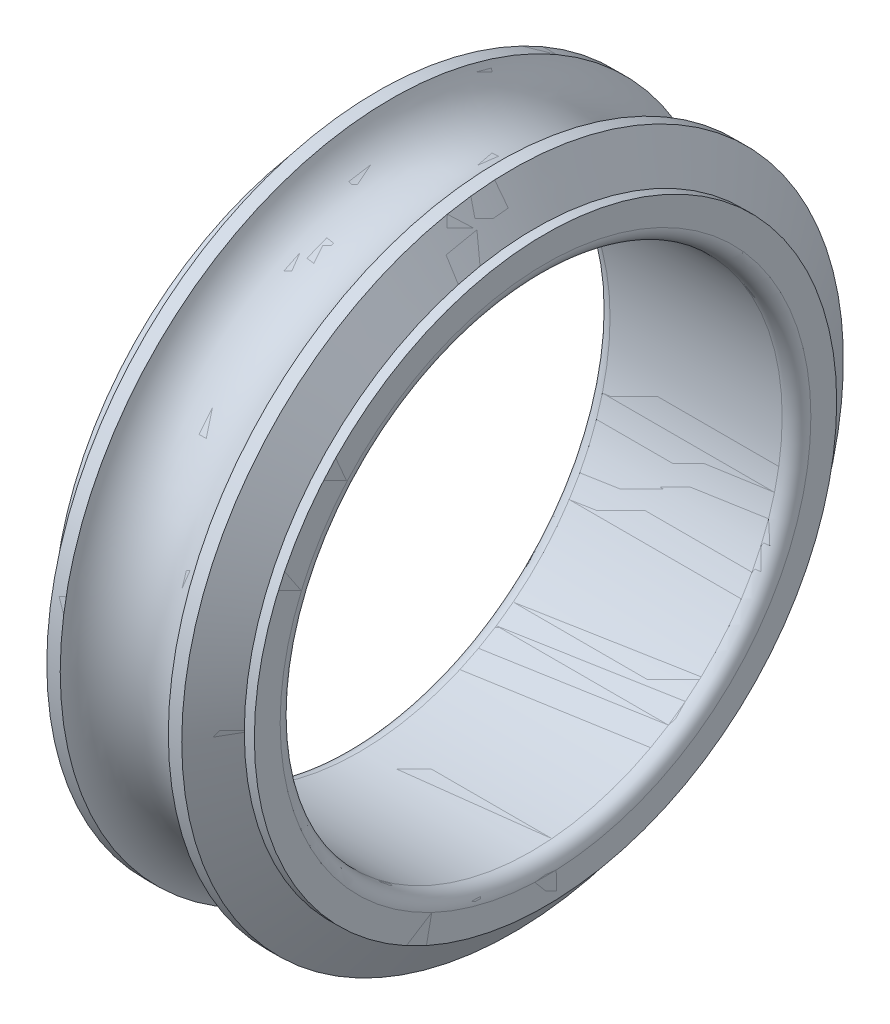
ISO-10303-21;
HEADER;
FILE_DESCRIPTION(('STEP AP214'),'2;1');
FILE_NAME('part.step','',(''),(''),'','','');
FILE_SCHEMA(('AUTOMOTIVE_DESIGN { 1 0 10303 214 1 1 1 1 }'));
ENDSEC;
DATA;
#1=APPLICATION_CONTEXT('core data for automotive mechanical design processes');
#2=APPLICATION_PROTOCOL_DEFINITION('international standard','automotive_design',2000,#1);
#3=PRODUCT_CONTEXT('',#1,'mechanical');
#4=PRODUCT('Part','Part','',(#3));
#5=PRODUCT_RELATED_PRODUCT_CATEGORY('part','',(#4));
#6=PRODUCT_DEFINITION_FORMATION('','',#4);
#7=PRODUCT_DEFINITION_CONTEXT('part definition',#1,'design');
#8=PRODUCT_DEFINITION('design','',#6,#7);
#9=PRODUCT_DEFINITION_SHAPE('','',#8);
#10=(LENGTH_UNIT() NAMED_UNIT(*) SI_UNIT(.MILLI.,.METRE.));
#11=(NAMED_UNIT(*) PLANE_ANGLE_UNIT() SI_UNIT($,.RADIAN.));
#12=(NAMED_UNIT(*) SI_UNIT($,.STERADIAN.) SOLID_ANGLE_UNIT());
#13=UNCERTAINTY_MEASURE_WITH_UNIT(LENGTH_MEASURE(1.E-05),#10,'distance_accuracy_value','');
#14=(GEOMETRIC_REPRESENTATION_CONTEXT(3) GLOBAL_UNCERTAINTY_ASSIGNED_CONTEXT((#13)) GLOBAL_UNIT_ASSIGNED_CONTEXT((#10,
#11,#12)) REPRESENTATION_CONTEXT('',''));
#15=CARTESIAN_POINT('',(0.,0.,0.));
#16=DIRECTION('',(0.,0.,1.));
#17=DIRECTION('',(1.,0.,0.));
#18=AXIS2_PLACEMENT_3D('',#15,#16,#17);
#19=CARTESIAN_POINT('',(13.,0.,0.));
#20=DIRECTION('',(-1.,0.,0.));
#21=DIRECTION('',(0.,0.,1.));
#22=AXIS2_PLACEMENT_3D('',#19,#20,#21);
#23=TOROIDAL_SURFACE('',#22,18.5,1.);
#24=CARTESIAN_POINT('',(14.,0.,0.));
#25=DIRECTION('',(-1.,0.,0.));
#26=DIRECTION('',(0.,0.,1.));
#27=AXIS2_PLACEMENT_3D('',#24,#25,#26);
#28=CIRCLE('',#27,18.5);
#29=CARTESIAN_POINT('',(14.,0.,18.5));
#30=VERTEX_POINT('',#29);
#31=EDGE_CURVE('P0_E10',#30,#30,#28,.T.);
#32=ORIENTED_EDGE('',*,*,#31,.F.);
#33=EDGE_LOOP('',(#32));
#34=FACE_BOUND('',#33,.T.);
#35=CARTESIAN_POINT('',(13.,0.,0.));
#36=DIRECTION('',(-1.,0.,0.));
#37=DIRECTION('',(0.,0.,1.));
#38=AXIS2_PLACEMENT_3D('',#35,#36,#37);
#39=CIRCLE('',#38,17.5);
#40=CARTESIAN_POINT('',(13.,0.,17.5));
#41=VERTEX_POINT('',#40);
#42=EDGE_CURVE('P0_E68',#41,#41,#39,.T.);
#43=ORIENTED_EDGE('',*,*,#42,.T.);
#44=EDGE_LOOP('',(#43));
#45=FACE_BOUND('',#44,.T.);
#46=ADVANCED_FACE('P0_F28',(#34,#45),#23,.T.);
#47=CARTESIAN_POINT('',(14.,18.5,0.));
#48=DIRECTION('',(-1.,0.,0.));
#49=DIRECTION('',(0.,0.,1.));
#50=AXIS2_PLACEMENT_3D('',#47,#48,#49);
#51=PLANE('',#50);
#52=CARTESIAN_POINT('',(14.,0.,0.));
#53=DIRECTION('',(-1.,0.,0.));
#54=DIRECTION('',(0.,0.,1.));
#55=AXIS2_PLACEMENT_3D('',#52,#53,#54);
#56=CIRCLE('',#55,20.3000001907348);
#57=CARTESIAN_POINT('',(14.,0.,20.3000001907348));
#58=VERTEX_POINT('',#57);
#59=EDGE_CURVE('P0_E34',#58,#58,#56,.T.);
#60=ORIENTED_EDGE('',*,*,#59,.F.);
#61=EDGE_LOOP('',(#60));
#62=FACE_BOUND('',#61,.T.);
#63=ORIENTED_EDGE('',*,*,#31,.T.);
#64=EDGE_LOOP('',(#63));
#65=FACE_BOUND('',#64,.T.);
#66=ADVANCED_FACE('P0_F122',(#62,#65),#51,.F.);
#67=CARTESIAN_POINT('',(0.,0.,0.));
#68=DIRECTION('',(-1.,0.,0.));
#69=DIRECTION('',(0.,0.,1.));
#70=AXIS2_PLACEMENT_3D('',#67,#68,#69);
#71=CYLINDRICAL_SURFACE('',#70,20.3000001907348);
#72=CARTESIAN_POINT('',(13.3,0.,0.));
#73=DIRECTION('',(-1.,0.,0.));
#74=DIRECTION('',(0.,0.,1.));
#75=AXIS2_PLACEMENT_3D('',#72,#73,#74);
#76=CIRCLE('',#75,20.3000001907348);
#77=CARTESIAN_POINT('',(13.3,0.,20.3000001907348));
#78=VERTEX_POINT('',#77);
#79=EDGE_CURVE('P0_E38',#78,#78,#76,.T.);
#80=ORIENTED_EDGE('',*,*,#79,.F.);
#81=EDGE_LOOP('',(#80));
#82=FACE_BOUND('',#81,.T.);
#83=ORIENTED_EDGE('',*,*,#59,.T.);
#84=EDGE_LOOP('',(#83));
#85=FACE_BOUND('',#84,.T.);
#86=ADVANCED_FACE('P0_F127',(#82,#85),#71,.T.);
#87=CARTESIAN_POINT('',(13.3,0.,0.));
#88=DIRECTION('',(-1.,0.,0.));
#89=DIRECTION('',(0.,0.,1.));
#90=AXIS2_PLACEMENT_3D('',#87,#88,#89);
#91=CONICAL_SURFACE('',#90,20.3000001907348,1.0471975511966);
#92=CARTESIAN_POINT('',(11.7036266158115,0.,0.));
#93=DIRECTION('',(-1.,0.,0.));
#94=DIRECTION('',(0.,0.,1.));
#95=AXIS2_PLACEMENT_3D('',#92,#93,#94);
#96=CIRCLE('',#95,23.065);
#97=CARTESIAN_POINT('',(11.7036266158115,0.,23.065));
#98=VERTEX_POINT('',#97);
#99=EDGE_CURVE('P0_E42',#98,#98,#96,.T.);
#100=ORIENTED_EDGE('',*,*,#99,.F.);
#101=EDGE_LOOP('',(#100));
#102=FACE_BOUND('',#101,.T.);
#103=ORIENTED_EDGE('',*,*,#79,.T.);
#104=EDGE_LOOP('',(#103));
#105=FACE_BOUND('',#104,.T.);
#106=ADVANCED_FACE('P0_F118',(#102,#105),#91,.T.);
#107=CARTESIAN_POINT('',(0.,0.,0.));
#108=DIRECTION('',(-1.,0.,0.));
#109=DIRECTION('',(0.,0.,1.));
#110=AXIS2_PLACEMENT_3D('',#107,#108,#109);
#111=CYLINDRICAL_SURFACE('',#110,23.065);
#112=CARTESIAN_POINT('',(10.7680598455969,0.,0.));
#113=DIRECTION('',(-1.,0.,0.));
#114=DIRECTION('',(0.,0.,1.));
#115=AXIS2_PLACEMENT_3D('',#112,#113,#114);
#116=CIRCLE('',#115,23.065);
#117=CARTESIAN_POINT('',(10.7680598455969,0.,23.065));
#118=VERTEX_POINT('',#117);
#119=EDGE_CURVE('P0_E47',#118,#118,#116,.T.);
#120=ORIENTED_EDGE('',*,*,#119,.F.);
#121=EDGE_LOOP('',(#120));
#122=FACE_BOUND('',#121,.T.);
#123=ORIENTED_EDGE('',*,*,#99,.T.);
#124=EDGE_LOOP('',(#123));
#125=FACE_BOUND('',#124,.T.);
#126=ADVANCED_FACE('P0_F112',(#122,#125),#111,.T.);
#127=CARTESIAN_POINT('',(7.,0.,0.));
#128=DIRECTION('',(-1.,0.,0.));
#129=DIRECTION('',(0.,0.,1.));
#130=AXIS2_PLACEMENT_3D('',#127,#128,#129);
#131=TOROIDAL_SURFACE('',#130,24.25,3.95);
#132=ORIENTED_EDGE('',*,*,#119,.T.);
#133=EDGE_LOOP('',(#132));
#134=FACE_BOUND('',#133,.T.);
#135=CARTESIAN_POINT('',(3.23194015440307,0.,0.));
#136=DIRECTION('',(-1.,0.,0.));
#137=DIRECTION('',(0.,0.,1.));
#138=AXIS2_PLACEMENT_3D('',#135,#136,#137);
#139=CIRCLE('',#138,23.065);
#140=CARTESIAN_POINT('',(3.23194015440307,0.,23.065));
#141=VERTEX_POINT('',#140);
#142=EDGE_CURVE('P0_E50',#141,#141,#139,.T.);
#143=ORIENTED_EDGE('',*,*,#142,.F.);
#144=EDGE_LOOP('',(#143));
#145=FACE_BOUND('',#144,.T.);
#146=ADVANCED_FACE('P0_F107',(#134,#145),#131,.F.);
#147=CARTESIAN_POINT('',(0.,0.,0.));
#148=DIRECTION('',(-1.,0.,0.));
#149=DIRECTION('',(0.,0.,1.));
#150=AXIS2_PLACEMENT_3D('',#147,#148,#149);
#151=CYLINDRICAL_SURFACE('',#150,23.065);
#152=CARTESIAN_POINT('',(2.2963733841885,0.,0.));
#153=DIRECTION('',(-1.,0.,0.));
#154=DIRECTION('',(0.,0.,1.));
#155=AXIS2_PLACEMENT_3D('',#152,#153,#154);
#156=CIRCLE('',#155,23.065);
#157=CARTESIAN_POINT('',(2.2963733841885,0.,23.065));
#158=VERTEX_POINT('',#157);
#159=EDGE_CURVE('P0_E53',#158,#158,#156,.T.);
#160=ORIENTED_EDGE('',*,*,#159,.F.);
#161=EDGE_LOOP('',(#160));
#162=FACE_BOUND('',#161,.T.);
#163=ORIENTED_EDGE('',*,*,#142,.T.);
#164=EDGE_LOOP('',(#163));
#165=FACE_BOUND('',#164,.T.);
#166=ADVANCED_FACE('P0_F101',(#162,#165),#151,.T.);
#167=CARTESIAN_POINT('',(2.2963733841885,0.,0.));
#168=DIRECTION('',(1.,0.,0.));
#169=DIRECTION('',(0.,0.,-1.));
#170=AXIS2_PLACEMENT_3D('',#167,#168,#169);
#171=CONICAL_SURFACE('',#170,23.065,1.0471975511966);
#172=CARTESIAN_POINT('',(0.7,0.,0.));
#173=DIRECTION('',(-1.,0.,0.));
#174=DIRECTION('',(0.,0.,1.));
#175=AXIS2_PLACEMENT_3D('',#172,#173,#174);
#176=CIRCLE('',#175,20.3000001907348);
#177=CARTESIAN_POINT('',(0.7,0.,20.3000001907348));
#178=VERTEX_POINT('',#177);
#179=EDGE_CURVE('P0_E56',#178,#178,#176,.T.);
#180=ORIENTED_EDGE('',*,*,#179,.F.);
#181=EDGE_LOOP('',(#180));
#182=FACE_BOUND('',#181,.T.);
#183=ORIENTED_EDGE('',*,*,#159,.T.);
#184=EDGE_LOOP('',(#183));
#185=FACE_BOUND('',#184,.T.);
#186=ADVANCED_FACE('P0_F95',(#182,#185),#171,.T.);
#187=CARTESIAN_POINT('',(0.,0.,0.));
#188=DIRECTION('',(-1.,0.,0.));
#189=DIRECTION('',(0.,0.,1.));
#190=AXIS2_PLACEMENT_3D('',#187,#188,#189);
#191=CYLINDRICAL_SURFACE('',#190,20.3000001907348);
#192=CARTESIAN_POINT('',(0.,0.,0.));
#193=DIRECTION('',(-1.,0.,0.));
#194=DIRECTION('',(0.,0.,1.));
#195=AXIS2_PLACEMENT_3D('',#192,#193,#194);
#196=CIRCLE('',#195,20.3000001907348);
#197=CARTESIAN_POINT('',(0.,0.,20.3000001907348));
#198=VERTEX_POINT('',#197);
#199=EDGE_CURVE('P0_E59',#198,#198,#196,.T.);
#200=ORIENTED_EDGE('',*,*,#199,.F.);
#201=EDGE_LOOP('',(#200));
#202=FACE_BOUND('',#201,.T.);
#203=ORIENTED_EDGE('',*,*,#179,.T.);
#204=EDGE_LOOP('',(#203));
#205=FACE_BOUND('',#204,.T.);
#206=ADVANCED_FACE('P0_F89',(#202,#205),#191,.T.);
#207=CARTESIAN_POINT('',(0.,20.3000001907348,0.));
#208=DIRECTION('',(1.,0.,0.));
#209=DIRECTION('',(0.,0.,-1.));
#210=AXIS2_PLACEMENT_3D('',#207,#208,#209);
#211=PLANE('',#210);
#212=CARTESIAN_POINT('',(0.,0.,0.));
#213=DIRECTION('',(-1.,0.,0.));
#214=DIRECTION('',(0.,0.,1.));
#215=AXIS2_PLACEMENT_3D('',#212,#213,#214);
#216=CIRCLE('',#215,18.5);
#217=CARTESIAN_POINT('',(0.,0.,18.5));
#218=VERTEX_POINT('',#217);
#219=EDGE_CURVE('P0_E62',#218,#218,#216,.T.);
#220=ORIENTED_EDGE('',*,*,#219,.F.);
#221=EDGE_LOOP('',(#220));
#222=FACE_BOUND('',#221,.T.);
#223=ORIENTED_EDGE('',*,*,#199,.T.);
#224=EDGE_LOOP('',(#223));
#225=FACE_BOUND('',#224,.T.);
#226=ADVANCED_FACE('P0_F82',(#222,#225),#211,.F.);
#227=CARTESIAN_POINT('',(1.,0.,0.));
#228=DIRECTION('',(-1.,0.,0.));
#229=DIRECTION('',(0.,0.,1.));
#230=AXIS2_PLACEMENT_3D('',#227,#228,#229);
#231=TOROIDAL_SURFACE('',#230,18.5,1.);
#232=CARTESIAN_POINT('',(1.,0.,0.));
#233=DIRECTION('',(-1.,0.,0.));
#234=DIRECTION('',(0.,0.,1.));
#235=AXIS2_PLACEMENT_3D('',#232,#233,#234);
#236=CIRCLE('',#235,17.5);
#237=CARTESIAN_POINT('',(1.,0.,17.5));
#238=VERTEX_POINT('',#237);
#239=EDGE_CURVE('P0_E65',#238,#238,#236,.T.);
#240=ORIENTED_EDGE('',*,*,#239,.F.);
#241=EDGE_LOOP('',(#240));
#242=FACE_BOUND('',#241,.T.);
#243=ORIENTED_EDGE('',*,*,#219,.T.);
#244=EDGE_LOOP('',(#243));
#245=FACE_BOUND('',#244,.T.);
#246=ADVANCED_FACE('P0_F76',(#242,#245),#231,.T.);
#247=CARTESIAN_POINT('',(0.,0.,0.));
#248=DIRECTION('',(-1.,0.,0.));
#249=DIRECTION('',(0.,0.,1.));
#250=AXIS2_PLACEMENT_3D('',#247,#248,#249);
#251=CYLINDRICAL_SURFACE('',#250,17.5);
#252=ORIENTED_EDGE('',*,*,#42,.F.);
#253=EDGE_LOOP('',(#252));
#254=FACE_BOUND('',#253,.T.);
#255=ORIENTED_EDGE('',*,*,#239,.T.);
#256=EDGE_LOOP('',(#255));
#257=FACE_BOUND('',#256,.T.);
#258=ADVANCED_FACE('P0_F73',(#254,#257),#251,.F.);
#259=CLOSED_SHELL('',(#46,#66,#86,#106,#126,#146,#166,#186,#206,#226,#246,#258));
#260=MANIFOLD_SOLID_BREP('P0_B2',#259);
#261=CARTESIAN_POINT('',(13.,0.,0.));
#262=DIRECTION('',(-1.,0.,0.));
#263=DIRECTION('',(0.,0.,1.));
#264=AXIS2_PLACEMENT_3D('',#261,#262,#263);
#265=TOROIDAL_SURFACE('',#264,18.5,1.);
#266=CARTESIAN_POINT('',(14.,0.,0.));
#267=DIRECTION('',(-1.,0.,0.));
#268=DIRECTION('',(0.,0.,1.));
#269=AXIS2_PLACEMENT_3D('',#266,#267,#268);
#270=CIRCLE('',#269,18.5);
#271=CARTESIAN_POINT('',(14.,0.,18.5));
#272=VERTEX_POINT('',#271);
#273=EDGE_CURVE('P1_E10',#272,#272,#270,.T.);
#274=ORIENTED_EDGE('',*,*,#273,.F.);
#275=EDGE_LOOP('',(#274));
#276=FACE_BOUND('',#275,.T.);
#277=CARTESIAN_POINT('',(13.,0.,0.));
#278=DIRECTION('',(-1.,0.,0.));
#279=DIRECTION('',(0.,0.,1.));
#280=AXIS2_PLACEMENT_3D('',#277,#278,#279);
#281=CIRCLE('',#280,17.5);
#282=CARTESIAN_POINT('',(13.,0.,17.5));
#283=VERTEX_POINT('',#282);
#284=EDGE_CURVE('P1_E54',#283,#283,#281,.T.);
#285=ORIENTED_EDGE('',*,*,#284,.T.);
#286=EDGE_LOOP('',(#285));
#287=FACE_BOUND('',#286,.T.);
#288=ADVANCED_FACE('P1_F14',(#276,#287),#265,.T.);
#289=CARTESIAN_POINT('',(14.,18.5,0.));
#290=DIRECTION('',(-1.,0.,0.));
#291=DIRECTION('',(0.,0.,1.));
#292=AXIS2_PLACEMENT_3D('',#289,#290,#291);
#293=PLANE('',#292);
#294=CARTESIAN_POINT('',(14.,0.,0.));
#295=DIRECTION('',(-1.,0.,0.));
#296=DIRECTION('',(0.,0.,1.));
#297=AXIS2_PLACEMENT_3D('',#294,#295,#296);
#298=CIRCLE('',#297,20.3000001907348);
#299=CARTESIAN_POINT('',(14.,0.,20.3000001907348));
#300=VERTEX_POINT('',#299);
#301=EDGE_CURVE('P1_E20',#300,#300,#298,.T.);
#302=ORIENTED_EDGE('',*,*,#301,.F.);
#303=EDGE_LOOP('',(#302));
#304=FACE_BOUND('',#303,.T.);
#305=ORIENTED_EDGE('',*,*,#273,.T.);
#306=EDGE_LOOP('',(#305));
#307=FACE_BOUND('',#306,.T.);
#308=ADVANCED_FACE('P1_F108',(#304,#307),#293,.F.);
#309=CARTESIAN_POINT('',(0.,0.,0.));
#310=DIRECTION('',(-1.,0.,0.));
#311=DIRECTION('',(0.,0.,1.));
#312=AXIS2_PLACEMENT_3D('',#309,#310,#311);
#313=CYLINDRICAL_SURFACE('',#312,20.3000001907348);
#314=CARTESIAN_POINT('',(13.3,0.,0.));
#315=DIRECTION('',(-1.,0.,0.));
#316=DIRECTION('',(0.,0.,1.));
#317=AXIS2_PLACEMENT_3D('',#314,#315,#316);
#318=CIRCLE('',#317,20.3000001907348);
#319=CARTESIAN_POINT('',(13.3,0.,20.3000001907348));
#320=VERTEX_POINT('',#319);
#321=EDGE_CURVE('P1_E24',#320,#320,#318,.T.);
#322=ORIENTED_EDGE('',*,*,#321,.F.);
#323=EDGE_LOOP('',(#322));
#324=FACE_BOUND('',#323,.T.);
#325=ORIENTED_EDGE('',*,*,#301,.T.);
#326=EDGE_LOOP('',(#325));
#327=FACE_BOUND('',#326,.T.);
#328=ADVANCED_FACE('P1_F113',(#324,#327),#313,.T.);
#329=CARTESIAN_POINT('',(13.3,0.,0.));
#330=DIRECTION('',(-1.,0.,0.));
#331=DIRECTION('',(0.,0.,1.));
#332=AXIS2_PLACEMENT_3D('',#329,#330,#331);
#333=CONICAL_SURFACE('',#332,20.3000001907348,1.0471975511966);
#334=CARTESIAN_POINT('',(11.7036266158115,0.,0.));
#335=DIRECTION('',(-1.,0.,0.));
#336=DIRECTION('',(0.,0.,1.));
#337=AXIS2_PLACEMENT_3D('',#334,#335,#336);
#338=CIRCLE('',#337,23.065);
#339=CARTESIAN_POINT('',(11.7036266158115,0.,23.065));
#340=VERTEX_POINT('',#339);
#341=EDGE_CURVE('P1_E28',#340,#340,#338,.T.);
#342=ORIENTED_EDGE('',*,*,#341,.F.);
#343=EDGE_LOOP('',(#342));
#344=FACE_BOUND('',#343,.T.);
#345=ORIENTED_EDGE('',*,*,#321,.T.);
#346=EDGE_LOOP('',(#345));
#347=FACE_BOUND('',#346,.T.);
#348=ADVANCED_FACE('P1_F104',(#344,#347),#333,.T.);
#349=CARTESIAN_POINT('',(0.,0.,0.));
#350=DIRECTION('',(-1.,0.,0.));
#351=DIRECTION('',(0.,0.,1.));
#352=AXIS2_PLACEMENT_3D('',#349,#350,#351);
#353=CYLINDRICAL_SURFACE('',#352,23.065);
#354=CARTESIAN_POINT('',(10.7680598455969,0.,0.));
#355=DIRECTION('',(-1.,0.,0.));
#356=DIRECTION('',(0.,0.,1.));
#357=AXIS2_PLACEMENT_3D('',#354,#355,#356);
#358=CIRCLE('',#357,23.065);
#359=CARTESIAN_POINT('',(10.7680598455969,0.,23.065));
#360=VERTEX_POINT('',#359);
#361=EDGE_CURVE('P1_E33',#360,#360,#358,.T.);
#362=ORIENTED_EDGE('',*,*,#361,.F.);
#363=EDGE_LOOP('',(#362));
#364=FACE_BOUND('',#363,.T.);
#365=ORIENTED_EDGE('',*,*,#341,.T.);
#366=EDGE_LOOP('',(#365));
#367=FACE_BOUND('',#366,.T.);
#368=ADVANCED_FACE('P1_F97',(#364,#367),#353,.T.);
#369=CARTESIAN_POINT('',(7.,0.,0.));
#370=DIRECTION('',(-1.,0.,0.));
#371=DIRECTION('',(0.,0.,1.));
#372=AXIS2_PLACEMENT_3D('',#369,#370,#371);
#373=TOROIDAL_SURFACE('',#372,24.25,3.95);
#374=ORIENTED_EDGE('',*,*,#361,.T.);
#375=EDGE_LOOP('',(#374));
#376=FACE_BOUND('',#375,.T.);
#377=CARTESIAN_POINT('',(3.23194015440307,0.,0.));
#378=DIRECTION('',(-1.,0.,0.));
#379=DIRECTION('',(0.,0.,1.));
#380=AXIS2_PLACEMENT_3D('',#377,#378,#379);
#381=CIRCLE('',#380,23.065);
#382=CARTESIAN_POINT('',(3.23194015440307,0.,23.065));
#383=VERTEX_POINT('',#382);
#384=EDGE_CURVE('P1_E36',#383,#383,#381,.T.);
#385=ORIENTED_EDGE('',*,*,#384,.F.);
#386=EDGE_LOOP('',(#385));
#387=FACE_BOUND('',#386,.T.);
#388=ADVANCED_FACE('P1_F92',(#376,#387),#373,.F.);
#389=CARTESIAN_POINT('',(0.,0.,0.));
#390=DIRECTION('',(-1.,0.,0.));
#391=DIRECTION('',(0.,0.,1.));
#392=AXIS2_PLACEMENT_3D('',#389,#390,#391);
#393=CYLINDRICAL_SURFACE('',#392,23.065);
#394=CARTESIAN_POINT('',(2.2963733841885,0.,0.));
#395=DIRECTION('',(-1.,0.,0.));
#396=DIRECTION('',(0.,0.,1.));
#397=AXIS2_PLACEMENT_3D('',#394,#395,#396);
#398=CIRCLE('',#397,23.065);
#399=CARTESIAN_POINT('',(2.2963733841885,0.,23.065));
#400=VERTEX_POINT('',#399);
#401=EDGE_CURVE('P1_E39',#400,#400,#398,.T.);
#402=ORIENTED_EDGE('',*,*,#401,.F.);
#403=EDGE_LOOP('',(#402));
#404=FACE_BOUND('',#403,.T.);
#405=ORIENTED_EDGE('',*,*,#384,.T.);
#406=EDGE_LOOP('',(#405));
#407=FACE_BOUND('',#406,.T.);
#408=ADVANCED_FACE('P1_F86',(#404,#407),#393,.T.);
#409=CARTESIAN_POINT('',(2.2963733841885,0.,0.));
#410=DIRECTION('',(1.,0.,0.));
#411=DIRECTION('',(0.,0.,-1.));
#412=AXIS2_PLACEMENT_3D('',#409,#410,#411);
#413=CONICAL_SURFACE('',#412,23.065,1.0471975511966);
#414=CARTESIAN_POINT('',(0.7,0.,0.));
#415=DIRECTION('',(-1.,0.,0.));
#416=DIRECTION('',(0.,0.,1.));
#417=AXIS2_PLACEMENT_3D('',#414,#415,#416);
#418=CIRCLE('',#417,20.3000001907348);
#419=CARTESIAN_POINT('',(0.7,0.,20.3000001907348));
#420=VERTEX_POINT('',#419);
#421=EDGE_CURVE('P1_E42',#420,#420,#418,.T.);
#422=ORIENTED_EDGE('',*,*,#421,.F.);
#423=EDGE_LOOP('',(#422));
#424=FACE_BOUND('',#423,.T.);
#425=ORIENTED_EDGE('',*,*,#401,.T.);
#426=EDGE_LOOP('',(#425));
#427=FACE_BOUND('',#426,.T.);
#428=ADVANCED_FACE('P1_F80',(#424,#427),#413,.T.);
#429=CARTESIAN_POINT('',(0.,0.,0.));
#430=DIRECTION('',(-1.,0.,0.));
#431=DIRECTION('',(0.,0.,1.));
#432=AXIS2_PLACEMENT_3D('',#429,#430,#431);
#433=CYLINDRICAL_SURFACE('',#432,20.3000001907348);
#434=CARTESIAN_POINT('',(0.,0.,0.));
#435=DIRECTION('',(-1.,0.,0.));
#436=DIRECTION('',(0.,0.,1.));
#437=AXIS2_PLACEMENT_3D('',#434,#435,#436);
#438=CIRCLE('',#437,20.3000001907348);
#439=CARTESIAN_POINT('',(0.,0.,20.3000001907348));
#440=VERTEX_POINT('',#439);
#441=EDGE_CURVE('P1_E45',#440,#440,#438,.T.);
#442=ORIENTED_EDGE('',*,*,#441,.F.);
#443=EDGE_LOOP('',(#442));
#444=FACE_BOUND('',#443,.T.);
#445=ORIENTED_EDGE('',*,*,#421,.T.);
#446=EDGE_LOOP('',(#445));
#447=FACE_BOUND('',#446,.T.);
#448=ADVANCED_FACE('P1_F74',(#444,#447),#433,.T.);
#449=CARTESIAN_POINT('',(0.,20.3000001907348,0.));
#450=DIRECTION('',(1.,0.,0.));
#451=DIRECTION('',(0.,0.,-1.));
#452=AXIS2_PLACEMENT_3D('',#449,#450,#451);
#453=PLANE('',#452);
#454=CARTESIAN_POINT('',(0.,0.,0.));
#455=DIRECTION('',(-1.,0.,0.));
#456=DIRECTION('',(0.,0.,1.));
#457=AXIS2_PLACEMENT_3D('',#454,#455,#456);
#458=CIRCLE('',#457,18.5);
#459=CARTESIAN_POINT('',(0.,0.,18.5));
#460=VERTEX_POINT('',#459);
#461=EDGE_CURVE('P1_E48',#460,#460,#458,.T.);
#462=ORIENTED_EDGE('',*,*,#461,.F.);
#463=EDGE_LOOP('',(#462));
#464=FACE_BOUND('',#463,.T.);
#465=ORIENTED_EDGE('',*,*,#441,.T.);
#466=EDGE_LOOP('',(#465));
#467=FACE_BOUND('',#466,.T.);
#468=ADVANCED_FACE('P1_F68',(#464,#467),#453,.F.);
#469=CARTESIAN_POINT('',(1.,0.,0.));
#470=DIRECTION('',(-1.,0.,0.));
#471=DIRECTION('',(0.,0.,1.));
#472=AXIS2_PLACEMENT_3D('',#469,#470,#471);
#473=TOROIDAL_SURFACE('',#472,18.5,1.);
#474=CARTESIAN_POINT('',(1.,0.,0.));
#475=DIRECTION('',(-1.,0.,0.));
#476=DIRECTION('',(0.,0.,1.));
#477=AXIS2_PLACEMENT_3D('',#474,#475,#476);
#478=CIRCLE('',#477,17.5);
#479=CARTESIAN_POINT('',(1.,0.,17.5));
#480=VERTEX_POINT('',#479);
#481=EDGE_CURVE('P1_E51',#480,#480,#478,.T.);
#482=ORIENTED_EDGE('',*,*,#481,.F.);
#483=EDGE_LOOP('',(#482));
#484=FACE_BOUND('',#483,.T.);
#485=ORIENTED_EDGE('',*,*,#461,.T.);
#486=EDGE_LOOP('',(#485));
#487=FACE_BOUND('',#486,.T.);
#488=ADVANCED_FACE('P1_F62',(#484,#487),#473,.T.);
#489=CARTESIAN_POINT('',(0.,0.,0.));
#490=DIRECTION('',(-1.,0.,0.));
#491=DIRECTION('',(0.,0.,1.));
#492=AXIS2_PLACEMENT_3D('',#489,#490,#491);
#493=CYLINDRICAL_SURFACE('',#492,17.5);
#494=ORIENTED_EDGE('',*,*,#284,.F.);
#495=EDGE_LOOP('',(#494));
#496=FACE_BOUND('',#495,.T.);
#497=ORIENTED_EDGE('',*,*,#481,.T.);
#498=EDGE_LOOP('',(#497));
#499=FACE_BOUND('',#498,.T.);
#500=ADVANCED_FACE('P1_F59',(#496,#499),#493,.F.);
#501=CLOSED_SHELL('',(#288,#308,#328,#348,#368,#388,#408,#428,#448,#468,#488,#500));
#502=MANIFOLD_SOLID_BREP('P1_B1',#501);
#503=ADVANCED_BREP_SHAPE_REPRESENTATION('',(#18,#260,#502),#14);
#504=SHAPE_DEFINITION_REPRESENTATION(#9,#503);
ENDSEC;
END-ISO-10303-21;
